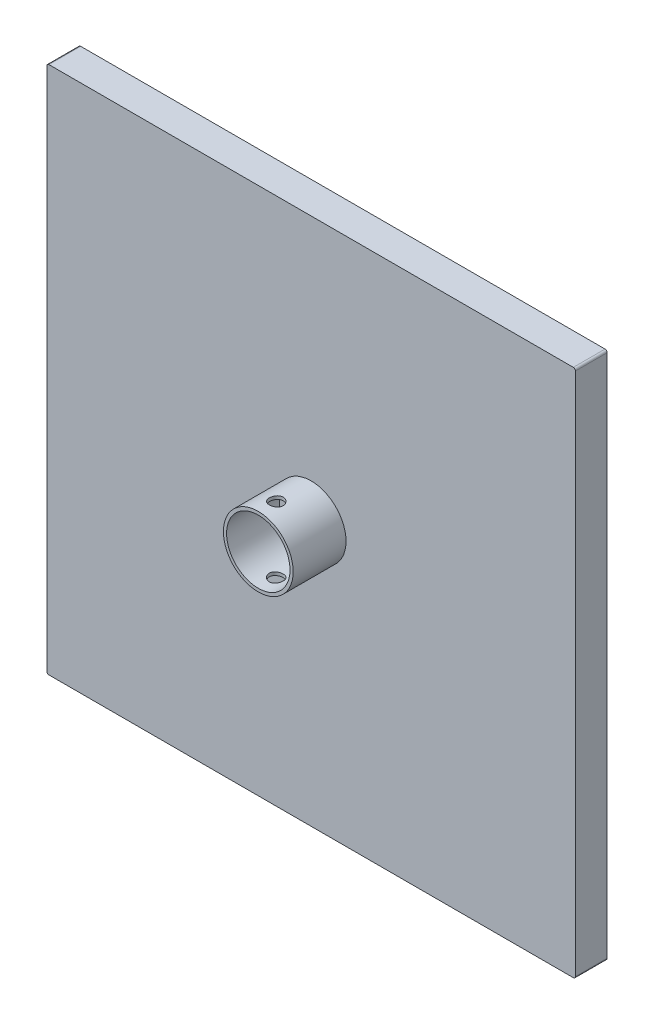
ISO-10303-21;
HEADER;
FILE_DESCRIPTION(('STEP AP214'),'2;1');
FILE_NAME('part.step','',(''),(''),'','','');
FILE_SCHEMA(('AUTOMOTIVE_DESIGN { 1 0 10303 214 1 1 1 1 }'));
ENDSEC;
DATA;
#1=APPLICATION_CONTEXT('core data for automotive mechanical design processes');
#2=APPLICATION_PROTOCOL_DEFINITION('international standard','automotive_design',2000,#1);
#3=PRODUCT_CONTEXT('',#1,'mechanical');
#4=PRODUCT('Part','Part','',(#3));
#5=PRODUCT_RELATED_PRODUCT_CATEGORY('part','',(#4));
#6=PRODUCT_DEFINITION_FORMATION('','',#4);
#7=PRODUCT_DEFINITION_CONTEXT('part definition',#1,'design');
#8=PRODUCT_DEFINITION('design','',#6,#7);
#9=PRODUCT_DEFINITION_SHAPE('','',#8);
#10=(LENGTH_UNIT() NAMED_UNIT(*) SI_UNIT(.MILLI.,.METRE.));
#11=(NAMED_UNIT(*) PLANE_ANGLE_UNIT() SI_UNIT($,.RADIAN.));
#12=(NAMED_UNIT(*) SI_UNIT($,.STERADIAN.) SOLID_ANGLE_UNIT());
#13=UNCERTAINTY_MEASURE_WITH_UNIT(LENGTH_MEASURE(1.E-05),#10,'distance_accuracy_value','');
#14=(GEOMETRIC_REPRESENTATION_CONTEXT(3) GLOBAL_UNCERTAINTY_ASSIGNED_CONTEXT((#13)) GLOBAL_UNIT_ASSIGNED_CONTEXT((#10,
#11,#12)) REPRESENTATION_CONTEXT('',''));
#15=CARTESIAN_POINT('',(0.,0.,0.));
#16=DIRECTION('',(0.,0.,1.));
#17=DIRECTION('',(1.,0.,0.));
#18=AXIS2_PLACEMENT_3D('',#15,#16,#17);
#19=CARTESIAN_POINT('',(0.,0.,80.));
#20=DIRECTION('',(0.,0.,-1.));
#21=DIRECTION('',(-1.,0.,0.));
#22=AXIS2_PLACEMENT_3D('',#19,#20,#21);
#23=CYLINDRICAL_SURFACE('',#22,33.);
#24=CARTESIAN_POINT('',(0.,-32.9999999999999,56.5));
#25=CARTESIAN_POINT('',(0.180742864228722,-33.0000017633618,56.4999964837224));
#26=CARTESIAN_POINT('',(0.361441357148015,-32.9985125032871,56.5075407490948));
#27=CARTESIAN_POINT('',(0.72158833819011,-32.9926008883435,56.5376513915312));
#28=CARTESIAN_POINT('',(0.901036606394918,-32.9881780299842,56.560220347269));
#29=CARTESIAN_POINT('',(1.25742778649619,-32.9765173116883,56.6202230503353));
#30=CARTESIAN_POINT('',(1.43436932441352,-32.969277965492,56.6576646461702));
#31=CARTESIAN_POINT('',(1.78446585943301,-32.9521836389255,56.7471338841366));
#32=CARTESIAN_POINT('',(1.95761943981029,-32.9423276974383,56.7991668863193));
#33=CARTESIAN_POINT('',(2.2986318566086,-32.9202893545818,56.9173350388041));
#34=CARTESIAN_POINT('',(2.46649742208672,-32.9081100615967,56.9834513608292));
#35=CARTESIAN_POINT('',(2.79608454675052,-32.8817465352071,57.1293609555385));
#36=CARTESIAN_POINT('',(2.9578038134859,-32.867561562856,57.2091592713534));
#37=CARTESIAN_POINT('',(3.27387029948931,-32.8375846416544,57.3817987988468));
#38=CARTESIAN_POINT('',(3.42822081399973,-32.8217934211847,57.4746341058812));
#39=CARTESIAN_POINT('',(3.72865827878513,-32.7890218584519,57.6727587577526));
#40=CARTESIAN_POINT('',(3.87474211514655,-32.77204107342,57.7780527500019));
#41=CARTESIAN_POINT('',(4.15923856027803,-32.7371579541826,58.0016165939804));
#42=CARTESIAN_POINT('',(4.29754450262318,-32.7192473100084,58.120020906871));
#43=CARTESIAN_POINT('',(4.56377361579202,-32.6831765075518,58.3680370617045));
#44=CARTESIAN_POINT('',(4.69169292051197,-32.6650162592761,58.4976530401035));
#45=CARTESIAN_POINT('',(4.93619066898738,-32.6289639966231,58.7671390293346));
#46=CARTESIAN_POINT('',(5.05277239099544,-32.6110719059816,58.907006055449));
#47=CARTESIAN_POINT('',(5.27387695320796,-32.576045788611,59.1961392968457));
#48=CARTESIAN_POINT('',(5.37839532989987,-32.5589120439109,59.3454089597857));
#49=CARTESIAN_POINT('',(5.57541962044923,-32.5257554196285,59.6535953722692));
#50=CARTESIAN_POINT('',(5.66781648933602,-32.509743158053,59.812583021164));
#51=CARTESIAN_POINT('',(5.83890204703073,-32.4794515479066,60.1380014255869));
#52=CARTESIAN_POINT('',(5.91758559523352,-32.4651728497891,60.3044349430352));
#53=CARTESIAN_POINT('',(6.06057430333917,-32.4387845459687,60.6434679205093));
#54=CARTESIAN_POINT('',(6.12488585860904,-32.4266739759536,60.8160645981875));
#55=CARTESIAN_POINT('',(6.23869092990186,-32.4049692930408,61.1662284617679));
#56=CARTESIAN_POINT('',(6.28817906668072,-32.3953760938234,61.3437974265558));
#57=CARTESIAN_POINT('',(6.41262604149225,-32.371063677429,61.8774842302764));
#58=CARTESIAN_POINT('',(6.46556070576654,-32.3604304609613,62.2393257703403));
#59=CARTESIAN_POINT('',(6.49899094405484,-32.3537175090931,62.7844112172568));
#60=CARTESIAN_POINT('',(6.50246447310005,-32.3530209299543,62.9665678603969));
#61=CARTESIAN_POINT('',(6.49413996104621,-32.3546932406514,63.3305401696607));
#62=CARTESIAN_POINT('',(6.48234168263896,-32.3570621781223,63.5123558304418));
#63=CARTESIAN_POINT('',(6.42464566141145,-32.3685924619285,64.0498874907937));
#64=CARTESIAN_POINT('',(6.35678400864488,-32.3821112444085,64.4034006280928));
#65=CARTESIAN_POINT('',(6.16399938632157,-32.4193546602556,65.0937386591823));
#66=CARTESIAN_POINT('',(6.03907376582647,-32.4430797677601,65.4305627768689));
#67=CARTESIAN_POINT('',(5.73485438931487,-32.4982369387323,66.0807547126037));
#68=CARTESIAN_POINT('',(5.55520877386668,-32.529718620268,66.3939538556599));
#69=CARTESIAN_POINT('',(5.14689842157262,-32.5968113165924,66.9860801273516));
#70=CARTESIAN_POINT('',(4.91822821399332,-32.6324227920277,67.2650034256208));
#71=CARTESIAN_POINT('',(4.41362031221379,-32.7045240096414,67.7857778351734));
#72=CARTESIAN_POINT('',(4.13692805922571,-32.741018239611,68.0268978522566));
#73=CARTESIAN_POINT('',(3.5466422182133,-32.8102040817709,68.4594145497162));
#74=CARTESIAN_POINT('',(3.2330481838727,-32.8428956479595,68.6508106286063));
#75=CARTESIAN_POINT('',(2.57706065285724,-32.9008693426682,68.9785760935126));
#76=CARTESIAN_POINT('',(2.23462529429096,-32.9261404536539,69.1148637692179));
#77=CARTESIAN_POINT('',(1.53111093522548,-32.966341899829,69.3277738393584));
#78=CARTESIAN_POINT('',(1.17003412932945,-32.9812734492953,69.4044032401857));
#79=CARTESIAN_POINT('',(0.445771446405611,-32.9989448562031,69.4947908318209));
#80=CARTESIAN_POINT('',(0.0827150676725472,-33.0018787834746,69.5095499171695));
#81=CARTESIAN_POINT('',(-0.640676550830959,-32.9957626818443,69.4784706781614));
#82=CARTESIAN_POINT('',(-1.00101193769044,-32.9867133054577,69.4326356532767));
#83=CARTESIAN_POINT('',(-1.70551738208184,-32.9577686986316,69.2825013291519));
#84=CARTESIAN_POINT('',(-2.04980075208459,-32.9379684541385,69.1787138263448));
#85=CARTESIAN_POINT('',(-2.71607876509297,-32.8897338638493,68.916177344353));
#86=CARTESIAN_POINT('',(-3.03807177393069,-32.8612988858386,68.7574243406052));
#87=CARTESIAN_POINT('',(-3.65486128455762,-32.7984655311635,68.3872903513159));
#88=CARTESIAN_POINT('',(-3.94928784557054,-32.7640001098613,68.1753045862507));
#89=CARTESIAN_POINT('',(-4.49875172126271,-32.6930898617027,67.7055166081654));
#90=CARTESIAN_POINT('',(-4.75378494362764,-32.6566448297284,67.4477096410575));
#91=CARTESIAN_POINT('',(-5.2210530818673,-32.5852329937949,66.8891144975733));
#92=CARTESIAN_POINT('',(-5.43260165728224,-32.5502959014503,66.5877487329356));
#93=CARTESIAN_POINT('',(-5.80212272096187,-32.4864703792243,65.9529674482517));
#94=CARTESIAN_POINT('',(-5.96009731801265,-32.4575817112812,65.6195531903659));
#95=CARTESIAN_POINT('',(-6.15285244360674,-32.4213902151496,65.1038164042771));
#96=CARTESIAN_POINT('',(-6.20966479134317,-32.4105316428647,64.9296746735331));
#97=CARTESIAN_POINT('',(-6.3084232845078,-32.3914549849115,64.5771003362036));
#98=CARTESIAN_POINT('',(-6.35037487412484,-32.3832359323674,64.3986693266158));
#99=CARTESIAN_POINT('',(-6.41907249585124,-32.3696884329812,64.0387912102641));
#100=CARTESIAN_POINT('',(-6.44581718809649,-32.3643602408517,63.8573438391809));
#101=CARTESIAN_POINT('',(-6.48388407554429,-32.3567555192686,63.4927766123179));
#102=CARTESIAN_POINT('',(-6.49520683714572,-32.3544788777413,63.3096568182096));
#103=CARTESIAN_POINT('',(-6.50227296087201,-32.353059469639,62.9463298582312));
#104=CARTESIAN_POINT('',(-6.49828674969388,-32.3538623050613,62.7661280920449));
#105=CARTESIAN_POINT('',(-6.47537182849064,-32.3584563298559,62.4067182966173));
#106=CARTESIAN_POINT('',(-6.45644339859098,-32.3622474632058,62.2275102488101));
#107=CARTESIAN_POINT('',(-6.40379049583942,-32.3727074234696,61.8713363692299));
#108=CARTESIAN_POINT('',(-6.37006349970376,-32.3793767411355,61.6943709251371));
#109=CARTESIAN_POINT('',(-6.28809246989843,-32.3953952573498,61.3440268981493));
#110=CARTESIAN_POINT('',(-6.23985361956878,-32.4047434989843,61.1706470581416));
#111=CARTESIAN_POINT('',(-6.12933232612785,-32.4258298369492,60.8289480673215));
#112=CARTESIAN_POINT('',(-6.06707735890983,-32.4375632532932,60.6606197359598));
#113=CARTESIAN_POINT('',(-5.92895843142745,-32.463092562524,60.3298767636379));
#114=CARTESIAN_POINT('',(-5.85309929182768,-32.4768877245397,60.1674600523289));
#115=CARTESIAN_POINT('',(-5.68826939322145,-32.506162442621,59.8494965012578));
#116=CARTESIAN_POINT('',(-5.59929322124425,-32.5216426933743,59.6939525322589));
#117=CARTESIAN_POINT('',(-5.40890824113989,-32.5538480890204,59.3908829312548));
#118=CARTESIAN_POINT('',(-5.30750370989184,-32.5705728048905,59.2433545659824));
#119=CARTESIAN_POINT('',(-5.09111539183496,-32.6051030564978,58.9548039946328));
#120=CARTESIAN_POINT('',(-4.97593144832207,-32.6229220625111,58.813933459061));
#121=CARTESIAN_POINT('',(-4.73422955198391,-32.6588730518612,58.5424114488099));
#122=CARTESIAN_POINT('',(-4.60771560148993,-32.6770049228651,58.4117563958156));
#123=CARTESIAN_POINT('',(-4.34409559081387,-32.7130943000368,58.1614161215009));
#124=CARTESIAN_POINT('',(-4.2069833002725,-32.7310516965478,58.041737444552));
#125=CARTESIAN_POINT('',(-3.92320710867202,-32.7662765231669,57.8142986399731));
#126=CARTESIAN_POINT('',(-3.77654674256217,-32.783544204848,57.7065341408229));
#127=CARTESIAN_POINT('',(-3.47302761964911,-32.817093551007,57.5025587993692));
#128=CARTESIAN_POINT('',(-3.31607795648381,-32.8333629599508,57.4064811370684));
#129=CARTESIAN_POINT('',(-2.9945341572,-32.8642486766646,57.227949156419));
#130=CARTESIAN_POINT('',(-2.82994286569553,-32.8788655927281,57.1454898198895));
#131=CARTESIAN_POINT('',(-2.49431269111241,-32.9060285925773,56.9948178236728));
#132=CARTESIAN_POINT('',(-2.32327784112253,-32.918575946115,56.9265964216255));
#133=CARTESIAN_POINT('',(-1.97594985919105,-32.9412497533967,56.8048812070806));
#134=CARTESIAN_POINT('',(-1.79965775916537,-32.9513766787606,56.7513845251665));
#135=CARTESIAN_POINT('',(-1.35708983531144,-32.9731425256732,56.6373996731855));
#136=CARTESIAN_POINT('',(-1.0883521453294,-32.9831623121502,56.5859441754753));
#137=CARTESIAN_POINT('',(-0.546375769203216,-32.9965896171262,56.5172475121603));
#138=CARTESIAN_POINT('',(-0.273137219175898,-32.9999973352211,56.5000053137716));
#139=CARTESIAN_POINT('',(0.,-32.9999999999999,56.5));
#140=B_SPLINE_CURVE_WITH_KNOTS('',3,(#24,#25,#26,#27,#28,#29,#30,#31,#32,#33,#34,#35,#36,#37,
#38,#39,#40,#41,#42,#43,#44,#45,#46,#47,#48,#49,#50,#51,#52,#53,#54,#55,#56,#57,#58,#59,#60,#61,
#62,#63,#64,#65,#66,#67,#68,#69,#70,#71,#72,#73,#74,#75,#76,#77,#78,#79,#80,#81,#82,#83,#84,#85,
#86,#87,#88,#89,#90,#91,#92,#93,#94,#95,#96,#97,#98,#99,#100,#101,#102,#103,#104,#105,#106,#107,
#108,#109,#110,#111,#112,#113,#114,#115,#116,#117,#118,#119,#120,#121,#122,#123,#124,#125,#126,
#127,#128,#129,#130,#131,#132,#133,#134,#135,#136,#137,#138,#139),.UNSPECIFIED.,.T.,.F.,(4,2,2,
2,2,2,2,2,2,2,2,2,2,2,2,2,2,2,2,2,2,2,2,2,2,2,2,2,2,2,2,2,2,2,2,2,2,2,2,2,2,2,2,2,2,2,2,2,2,2,2,
2,2,2,2,2,2,4),(0.,0.541988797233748,1.08407063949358,1.62643892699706,2.16900671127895,
2.71085362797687,3.25290069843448,3.79470305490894,4.33670815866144,4.8849034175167,
5.43330179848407,5.98154113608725,6.52998267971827,7.08306161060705,7.63634742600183,
8.18938654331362,8.74262610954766,9.83381858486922,10.3798576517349,10.9259052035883,
12.0010559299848,13.0762566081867,14.1585224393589,15.2409091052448,16.3421661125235,
17.4434364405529,18.546333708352,19.6491014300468,20.7339588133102,21.8187571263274,
22.8941234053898,23.9695684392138,25.0578330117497,26.146210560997,27.250632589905,
28.3550111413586,28.9049488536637,29.4546848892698,30.0044693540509,30.554233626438,
31.0943315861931,31.634419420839,32.1745993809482,32.7145866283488,33.2535244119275,
33.7922715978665,34.3312417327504,34.8700269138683,35.4178979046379,35.9655761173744,
36.5135787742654,37.0613796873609,37.6149319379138,38.1682797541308,38.7212867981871,
39.2741860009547,40.0932600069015,40.9123092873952),.UNSPECIFIED.);
#141=CARTESIAN_POINT('',(0.,-32.9999999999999,56.5));
#142=VERTEX_POINT('',#141);
#143=EDGE_CURVE('E174',#142,#142,#140,.T.);
#144=ORIENTED_EDGE('',*,*,#143,.F.);
#145=EDGE_LOOP('',(#144));
#146=FACE_BOUND('',#145,.T.);
#147=CARTESIAN_POINT('',(0.,0.,80.));
#148=DIRECTION('',(0.,0.,1.));
#149=DIRECTION('',(1.,0.,0.));
#150=AXIS2_PLACEMENT_3D('',#147,#148,#149);
#151=CIRCLE('',#150,33.);
#152=CARTESIAN_POINT('',(32.9999999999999,0.,80.));
#153=VERTEX_POINT('',#152);
#154=EDGE_CURVE('E132',#153,#153,#151,.T.);
#155=ORIENTED_EDGE('',*,*,#154,.F.);
#156=EDGE_LOOP('',(#155));
#157=FACE_BOUND('',#156,.T.);
#158=CARTESIAN_POINT('',(0.,0.,30.));
#159=DIRECTION('',(0.,0.,1.));
#160=DIRECTION('',(1.,0.,0.));
#161=AXIS2_PLACEMENT_3D('',#158,#159,#160);
#162=CIRCLE('',#161,33.);
#163=CARTESIAN_POINT('',(32.9999999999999,0.,30.));
#164=VERTEX_POINT('',#163);
#165=EDGE_CURVE('E138',#164,#164,#162,.T.);
#166=ORIENTED_EDGE('',*,*,#165,.T.);
#167=EDGE_LOOP('',(#166));
#168=FACE_BOUND('',#167,.T.);
#169=CARTESIAN_POINT('',(0.,33.0000000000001,56.5));
#170=CARTESIAN_POINT('',(-0.180742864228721,33.0000017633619,56.4999964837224));
#171=CARTESIAN_POINT('',(-0.361441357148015,32.9985125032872,56.5075407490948));
#172=CARTESIAN_POINT('',(-0.72158833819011,32.9926008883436,56.5376513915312));
#173=CARTESIAN_POINT('',(-0.901036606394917,32.9881780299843,56.560220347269));
#174=CARTESIAN_POINT('',(-1.25742778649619,32.9765173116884,56.6202230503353));
#175=CARTESIAN_POINT('',(-1.43436932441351,32.9692779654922,56.6576646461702));
#176=CARTESIAN_POINT('',(-1.78446585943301,32.9521836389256,56.7471338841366));
#177=CARTESIAN_POINT('',(-1.95761943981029,32.9423276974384,56.7991668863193));
#178=CARTESIAN_POINT('',(-2.29863185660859,32.9202893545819,56.9173350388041));
#179=CARTESIAN_POINT('',(-2.46649742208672,32.9081100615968,56.9834513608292));
#180=CARTESIAN_POINT('',(-2.79608454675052,32.8817465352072,57.1293609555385));
#181=CARTESIAN_POINT('',(-2.9578038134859,32.8675615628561,57.2091592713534));
#182=CARTESIAN_POINT('',(-3.27387029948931,32.8375846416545,57.3817987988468));
#183=CARTESIAN_POINT('',(-3.42822081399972,32.8217934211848,57.4746341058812));
#184=CARTESIAN_POINT('',(-3.72865827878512,32.789021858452,57.6727587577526));
#185=CARTESIAN_POINT('',(-3.87474211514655,32.7720410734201,57.7780527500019));
#186=CARTESIAN_POINT('',(-4.15923856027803,32.7371579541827,58.0016165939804));
#187=CARTESIAN_POINT('',(-4.29754450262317,32.7192473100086,58.120020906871));
#188=CARTESIAN_POINT('',(-4.56377361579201,32.6831765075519,58.3680370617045));
#189=CARTESIAN_POINT('',(-4.69169292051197,32.6650162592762,58.4976530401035));
#190=CARTESIAN_POINT('',(-4.93619066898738,32.6289639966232,58.7671390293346));
#191=CARTESIAN_POINT('',(-5.05277239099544,32.6110719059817,58.907006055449));
#192=CARTESIAN_POINT('',(-5.27387695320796,32.5760457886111,59.1961392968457));
#193=CARTESIAN_POINT('',(-5.37839532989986,32.5589120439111,59.3454089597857));
#194=CARTESIAN_POINT('',(-5.57541962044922,32.5257554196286,59.6535953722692));
#195=CARTESIAN_POINT('',(-5.66781648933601,32.5097431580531,59.812583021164));
#196=CARTESIAN_POINT('',(-5.83890204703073,32.4794515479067,60.1380014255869));
#197=CARTESIAN_POINT('',(-5.91758559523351,32.4651728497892,60.3044349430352));
#198=CARTESIAN_POINT('',(-6.06057430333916,32.4387845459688,60.6434679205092));
#199=CARTESIAN_POINT('',(-6.12488585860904,32.4266739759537,60.8160645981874));
#200=CARTESIAN_POINT('',(-6.23869092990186,32.4049692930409,61.1662284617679));
#201=CARTESIAN_POINT('',(-6.28817906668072,32.3953760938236,61.3437974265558));
#202=CARTESIAN_POINT('',(-6.41262604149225,32.3710636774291,61.8774842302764));
#203=CARTESIAN_POINT('',(-6.46556070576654,32.3604304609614,62.2393257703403));
#204=CARTESIAN_POINT('',(-6.49899094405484,32.3537175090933,62.7844112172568));
#205=CARTESIAN_POINT('',(-6.50246447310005,32.3530209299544,62.9665678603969));
#206=CARTESIAN_POINT('',(-6.49413996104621,32.3546932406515,63.3305401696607));
#207=CARTESIAN_POINT('',(-6.48234168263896,32.3570621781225,63.5123558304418));
#208=CARTESIAN_POINT('',(-6.42464566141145,32.3685924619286,64.0498874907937));
#209=CARTESIAN_POINT('',(-6.35678400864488,32.3821112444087,64.4034006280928));
#210=CARTESIAN_POINT('',(-6.16399938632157,32.4193546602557,65.0937386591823));
#211=CARTESIAN_POINT('',(-6.03907376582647,32.4430797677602,65.4305627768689));
#212=CARTESIAN_POINT('',(-5.73485438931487,32.4982369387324,66.0807547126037));
#213=CARTESIAN_POINT('',(-5.55520877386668,32.5297186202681,66.3939538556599));
#214=CARTESIAN_POINT('',(-5.14689842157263,32.5968113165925,66.9860801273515));
#215=CARTESIAN_POINT('',(-4.91822821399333,32.6324227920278,67.2650034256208));
#216=CARTESIAN_POINT('',(-4.4136203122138,32.7045240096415,67.7857778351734));
#217=CARTESIAN_POINT('',(-4.13692805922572,32.7410182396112,68.0268978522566));
#218=CARTESIAN_POINT('',(-3.5466422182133,32.810204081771,68.4594145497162));
#219=CARTESIAN_POINT('',(-3.23304818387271,32.8428956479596,68.6508106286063));
#220=CARTESIAN_POINT('',(-2.57706065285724,32.9008693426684,68.9785760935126));
#221=CARTESIAN_POINT('',(-2.23462529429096,32.926140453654,69.1148637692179));
#222=CARTESIAN_POINT('',(-1.53111093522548,32.9663418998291,69.3277738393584));
#223=CARTESIAN_POINT('',(-1.17003412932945,32.9812734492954,69.4044032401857));
#224=CARTESIAN_POINT('',(-0.445771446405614,32.9989448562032,69.4947908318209));
#225=CARTESIAN_POINT('',(-0.0827150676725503,33.0018787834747,69.5095499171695));
#226=CARTESIAN_POINT('',(0.640676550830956,32.9957626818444,69.4784706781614));
#227=CARTESIAN_POINT('',(1.00101193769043,32.9867133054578,69.4326356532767));
#228=CARTESIAN_POINT('',(1.70551738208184,32.9577686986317,69.2825013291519));
#229=CARTESIAN_POINT('',(2.04980075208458,32.9379684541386,69.1787138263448));
#230=CARTESIAN_POINT('',(2.71607876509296,32.8897338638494,68.916177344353));
#231=CARTESIAN_POINT('',(3.03807177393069,32.8612988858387,68.7574243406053));
#232=CARTESIAN_POINT('',(3.65486128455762,32.7984655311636,68.3872903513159));
#233=CARTESIAN_POINT('',(3.94928784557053,32.7640001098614,68.1753045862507));
#234=CARTESIAN_POINT('',(4.4987517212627,32.6930898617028,67.7055166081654));
#235=CARTESIAN_POINT('',(4.75378494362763,32.6566448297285,67.4477096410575));
#236=CARTESIAN_POINT('',(5.2210530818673,32.585232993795,66.8891144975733));
#237=CARTESIAN_POINT('',(5.43260165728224,32.5502959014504,66.5877487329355));
#238=CARTESIAN_POINT('',(5.80212272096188,32.4864703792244,65.9529674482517));
#239=CARTESIAN_POINT('',(5.96009731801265,32.4575817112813,65.6195531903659));
#240=CARTESIAN_POINT('',(6.15285244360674,32.4213902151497,65.1038164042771));
#241=CARTESIAN_POINT('',(6.20966479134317,32.4105316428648,64.9296746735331));
#242=CARTESIAN_POINT('',(6.3084232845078,32.3914549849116,64.5771003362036));
#243=CARTESIAN_POINT('',(6.35037487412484,32.3832359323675,64.3986693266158));
#244=CARTESIAN_POINT('',(6.41907249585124,32.3696884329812,64.0387912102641));
#245=CARTESIAN_POINT('',(6.44581718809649,32.3643602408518,63.8573438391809));
#246=CARTESIAN_POINT('',(6.48388407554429,32.3567555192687,63.4927766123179));
#247=CARTESIAN_POINT('',(6.49520683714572,32.3544788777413,63.3096568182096));
#248=CARTESIAN_POINT('',(6.50227296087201,32.3530594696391,62.9463298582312));
#249=CARTESIAN_POINT('',(6.49828674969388,32.3538623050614,62.7661280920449));
#250=CARTESIAN_POINT('',(6.47537182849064,32.358456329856,62.4067182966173));
#251=CARTESIAN_POINT('',(6.45644339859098,32.3622474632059,62.2275102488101));
#252=CARTESIAN_POINT('',(6.40379049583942,32.3727074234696,61.8713363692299));
#253=CARTESIAN_POINT('',(6.37006349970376,32.3793767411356,61.6943709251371));
#254=CARTESIAN_POINT('',(6.28809246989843,32.3953952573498,61.3440268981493));
#255=CARTESIAN_POINT('',(6.23985361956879,32.4047434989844,61.1706470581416));
#256=CARTESIAN_POINT('',(6.12933232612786,32.4258298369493,60.8289480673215));
#257=CARTESIAN_POINT('',(6.06707735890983,32.4375632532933,60.6606197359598));
#258=CARTESIAN_POINT('',(5.92895843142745,32.4630925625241,60.3298767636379));
#259=CARTESIAN_POINT('',(5.85309929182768,32.4768877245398,60.1674600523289));
#260=CARTESIAN_POINT('',(5.68826939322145,32.506162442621,59.8494965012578));
#261=CARTESIAN_POINT('',(5.59929322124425,32.5216426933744,59.693952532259));
#262=CARTESIAN_POINT('',(5.4089082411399,32.5538480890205,59.3908829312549));
#263=CARTESIAN_POINT('',(5.30750370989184,32.5705728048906,59.2433545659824));
#264=CARTESIAN_POINT('',(5.09111539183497,32.6051030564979,58.9548039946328));
#265=CARTESIAN_POINT('',(4.97593144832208,32.6229220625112,58.8139334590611));
#266=CARTESIAN_POINT('',(4.73422955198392,32.6588730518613,58.5424114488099));
#267=CARTESIAN_POINT('',(4.60771560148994,32.6770049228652,58.4117563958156));
#268=CARTESIAN_POINT('',(4.34409559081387,32.7130943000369,58.1614161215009));
#269=CARTESIAN_POINT('',(4.2069833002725,32.7310516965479,58.041737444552));
#270=CARTESIAN_POINT('',(3.92320710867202,32.766276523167,57.8142986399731));
#271=CARTESIAN_POINT('',(3.77654674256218,32.7835442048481,57.7065341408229));
#272=CARTESIAN_POINT('',(3.47302761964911,32.8170935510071,57.5025587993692));
#273=CARTESIAN_POINT('',(3.31607795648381,32.8333629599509,57.4064811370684));
#274=CARTESIAN_POINT('',(2.9945341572,32.8642486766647,57.227949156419));
#275=CARTESIAN_POINT('',(2.82994286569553,32.8788655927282,57.1454898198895));
#276=CARTESIAN_POINT('',(2.49431269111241,32.9060285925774,56.9948178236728));
#277=CARTESIAN_POINT('',(2.32327784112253,32.9185759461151,56.9265964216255));
#278=CARTESIAN_POINT('',(1.97594985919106,32.9412497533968,56.8048812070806));
#279=CARTESIAN_POINT('',(1.79965775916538,32.9513766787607,56.7513845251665));
#280=CARTESIAN_POINT('',(1.35708983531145,32.9731425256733,56.6373996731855));
#281=CARTESIAN_POINT('',(1.08835214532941,32.9831623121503,56.5859441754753));
#282=CARTESIAN_POINT('',(0.546375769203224,32.9965896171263,56.5172475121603));
#283=CARTESIAN_POINT('',(0.273137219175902,32.9999973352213,56.5000053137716));
#284=CARTESIAN_POINT('',(0.,33.0000000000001,56.5));
#285=B_SPLINE_CURVE_WITH_KNOTS('',3,(#169,#170,#171,#172,#173,#174,#175,#176,#177,#178,#179,
#180,#181,#182,#183,#184,#185,#186,#187,#188,#189,#190,#191,#192,#193,#194,#195,#196,#197,#198,
#199,#200,#201,#202,#203,#204,#205,#206,#207,#208,#209,#210,#211,#212,#213,#214,#215,#216,#217,
#218,#219,#220,#221,#222,#223,#224,#225,#226,#227,#228,#229,#230,#231,#232,#233,#234,#235,#236,
#237,#238,#239,#240,#241,#242,#243,#244,#245,#246,#247,#248,#249,#250,#251,#252,#253,#254,#255,
#256,#257,#258,#259,#260,#261,#262,#263,#264,#265,#266,#267,#268,#269,#270,#271,#272,#273,#274,
#275,#276,#277,#278,#279,#280,#281,#282,#283,#284),.UNSPECIFIED.,.T.,.F.,(4,2,2,2,2,2,2,2,2,2,2,
2,2,2,2,2,2,2,2,2,2,2,2,2,2,2,2,2,2,2,2,2,2,2,2,2,2,2,2,2,2,2,2,2,2,2,2,2,2,2,2,2,2,2,2,2,2,4),
(0.,0.541988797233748,1.08407063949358,1.62643892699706,2.16900671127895,2.71085362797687,
3.25290069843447,3.79470305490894,4.33670815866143,4.88490341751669,5.43330179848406,
5.98154113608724,6.52998267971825,7.08306161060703,7.63634742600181,8.18938654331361,
8.74262610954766,9.8338185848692,10.3798576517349,10.9259052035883,12.0010559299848,
13.0762566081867,14.1585224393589,15.2409091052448,16.3421661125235,17.4434364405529,
18.546333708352,19.6491014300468,20.7339588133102,21.8187571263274,22.8941234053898,
23.9695684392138,25.0578330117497,26.146210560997,27.250632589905,28.3550111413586,
28.9049488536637,29.4546848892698,30.0044693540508,30.554233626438,31.0943315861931,
31.634419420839,32.1745993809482,32.7145866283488,33.2535244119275,33.7922715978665,
34.3312417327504,34.8700269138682,35.4178979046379,35.9655761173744,36.5135787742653,
37.0613796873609,37.6149319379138,38.1682797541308,38.7212867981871,39.2741860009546,
40.0932600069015,40.9123092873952),.UNSPECIFIED.);
#286=CARTESIAN_POINT('',(0.,33.0000000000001,56.5));
#287=VERTEX_POINT('',#286);
#288=EDGE_CURVE('E179',#287,#287,#285,.T.);
#289=ORIENTED_EDGE('',*,*,#288,.F.);
#290=EDGE_LOOP('',(#289));
#291=FACE_BOUND('',#290,.T.);
#292=ADVANCED_FACE('F37',(#146,#157,#168,#291),#23,.T.);
#293=CARTESIAN_POINT('',(0.,0.,80.));
#294=DIRECTION('',(0.,0.,-1.));
#295=DIRECTION('',(-1.,0.,0.));
#296=AXIS2_PLACEMENT_3D('',#293,#294,#295);
#297=CYLINDRICAL_SURFACE('',#296,30.);
#298=CARTESIAN_POINT('',(0.,-29.9999999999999,56.5));
#299=CARTESIAN_POINT('',(0.180355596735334,-30.0000022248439,56.499995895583));
#300=CARTESIAN_POINT('',(0.360661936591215,-29.9983708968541,56.507508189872));
#301=CARTESIAN_POINT('',(0.720022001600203,-29.9918959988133,56.5374880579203));
#302=CARTESIAN_POINT('',(0.899075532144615,-29.9870519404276,56.5599579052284));
#303=CARTESIAN_POINT('',(1.25466133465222,-29.9742807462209,56.6196904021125));
#304=CARTESIAN_POINT('',(1.43119242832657,-29.9663522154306,56.6569597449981));
#305=CARTESIAN_POINT('',(1.78047029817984,-29.9476296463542,56.7460079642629));
#306=CARTESIAN_POINT('',(1.95321565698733,-29.9368345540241,56.7977921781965));
#307=CARTESIAN_POINT('',(2.29340522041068,-29.9126951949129,56.9153770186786));
#308=CARTESIAN_POINT('',(2.46085661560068,-29.8993545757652,56.9811576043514));
#309=CARTESIAN_POINT('',(2.78963636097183,-29.8704732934,57.126310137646));
#310=CARTESIAN_POINT('',(2.95096242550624,-29.8549318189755,57.2056870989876));
#311=CARTESIAN_POINT('',(3.26628315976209,-29.8220809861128,57.3774018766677));
#312=CARTESIAN_POINT('',(3.42028087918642,-29.8047723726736,57.4697342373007));
#313=CARTESIAN_POINT('',(3.72006420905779,-29.7688415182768,57.6667731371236));
#314=CARTESIAN_POINT('',(3.86584671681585,-29.7502187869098,57.7714843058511));
#315=CARTESIAN_POINT('',(4.15013727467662,-29.7119036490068,57.9940637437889));
#316=CARTESIAN_POINT('',(4.28851759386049,-29.6922000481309,58.1120932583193));
#317=CARTESIAN_POINT('',(4.554933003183,-29.6524996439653,58.3593506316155));
#318=CARTESIAN_POINT('',(4.68296423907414,-29.6325027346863,58.4885826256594));
#319=CARTESIAN_POINT('',(4.92773386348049,-29.5927830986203,58.7573050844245));
#320=CARTESIAN_POINT('',(5.04447538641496,-29.5730602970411,58.8967926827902));
#321=CARTESIAN_POINT('',(5.26595153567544,-29.5344273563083,59.1851837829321));
#322=CARTESIAN_POINT('',(5.37068171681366,-29.5155175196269,59.3340907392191));
#323=CARTESIAN_POINT('',(5.56838495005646,-29.4788620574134,59.6418916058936));
#324=CARTESIAN_POINT('',(5.66122319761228,-29.4611307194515,59.8008738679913));
#325=CARTESIAN_POINT('',(5.83318637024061,-29.4275655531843,60.1263550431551));
#326=CARTESIAN_POINT('',(5.91230613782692,-29.4117324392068,60.2928567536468));
#327=CARTESIAN_POINT('',(6.05614978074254,-29.3824514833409,60.6321000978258));
#328=CARTESIAN_POINT('',(6.12088030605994,-29.3690025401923,60.8048388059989));
#329=CARTESIAN_POINT('',(6.23549482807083,-29.3448799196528,61.1553600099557));
#330=CARTESIAN_POINT('',(6.28537345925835,-29.3342072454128,61.3331443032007));
#331=CARTESIAN_POINT('',(6.41070339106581,-29.307176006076,61.8666539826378));
#332=CARTESIAN_POINT('',(6.46422461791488,-29.295302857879,62.2281624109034));
#333=CARTESIAN_POINT('',(6.49859409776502,-29.2876800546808,62.7728502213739));
#334=CARTESIAN_POINT('',(6.50239088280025,-29.2868386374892,62.954890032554));
#335=CARTESIAN_POINT('',(6.4947308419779,-29.2885386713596,63.3186549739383));
#336=CARTESIAN_POINT('',(6.48327380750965,-29.291080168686,63.5003800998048));
#337=CARTESIAN_POINT('',(6.4267416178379,-29.3035627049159,64.0364907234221));
#338=CARTESIAN_POINT('',(6.35992331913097,-29.3182712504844,64.3887171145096));
#339=CARTESIAN_POINT('',(6.16968990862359,-29.3588860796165,65.0766533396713));
#340=CARTESIAN_POINT('',(6.04627167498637,-29.3847929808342,65.412362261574));
#341=CARTESIAN_POINT('',(5.74534488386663,-29.4451125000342,66.0610083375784));
#342=CARTESIAN_POINT('',(5.56742063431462,-29.4795900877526,66.3737467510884));
#343=CARTESIAN_POINT('',(5.16282569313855,-29.5531280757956,66.965314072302));
#344=CARTESIAN_POINT('',(4.93614847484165,-29.5921890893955,67.2441384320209));
#345=CARTESIAN_POINT('',(4.4347718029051,-29.6715086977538,67.7661839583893));
#346=CARTESIAN_POINT('',(4.15915589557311,-29.7117751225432,68.0085247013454));
#347=CARTESIAN_POINT('',(3.57074137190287,-29.7882138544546,68.443685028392));
#348=CARTESIAN_POINT('',(3.25794210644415,-29.8243860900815,68.6365037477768));
#349=CARTESIAN_POINT('',(2.60297638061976,-29.8886747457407,68.9673591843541));
#350=CARTESIAN_POINT('',(2.26075073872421,-29.9167744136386,69.1052822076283));
#351=CARTESIAN_POINT('',(1.5572374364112,-29.9616270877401,69.3214215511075));
#352=CARTESIAN_POINT('',(1.19595250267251,-29.9783817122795,69.39964638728));
#353=CARTESIAN_POINT('',(0.472130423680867,-29.9984267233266,69.4928921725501));
#354=CARTESIAN_POINT('',(0.109755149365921,-30.001973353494,69.5091161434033));
#355=CARTESIAN_POINT('',(-0.612527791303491,-29.9959201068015,69.4811578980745));
#356=CARTESIAN_POINT('',(-0.972435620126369,-29.9863211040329,69.436979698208));
#357=CARTESIAN_POINT('',(-1.67559309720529,-29.9552167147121,69.2904693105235));
#358=CARTESIAN_POINT('',(-2.01898010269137,-29.9338402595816,69.1887665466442));
#359=CARTESIAN_POINT('',(-2.68382182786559,-29.881572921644,68.9307901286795));
#360=CARTESIAN_POINT('',(-3.00527470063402,-29.850681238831,68.7745118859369));
#361=CARTESIAN_POINT('',(-3.62210784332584,-29.782177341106,68.4093079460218));
#362=CARTESIAN_POINT('',(-3.91705845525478,-29.7444768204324,68.1996735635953));
#363=CARTESIAN_POINT('',(-4.46802997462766,-29.6667198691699,67.7346252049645));
#364=CARTESIAN_POINT('',(-4.72404591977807,-29.6266631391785,67.479205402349));
#365=CARTESIAN_POINT('',(-5.19460588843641,-29.547827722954,66.924388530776));
#366=CARTESIAN_POINT('',(-5.40831739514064,-29.5090851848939,66.6242805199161));
#367=CARTESIAN_POINT('',(-5.7823569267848,-29.4380844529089,65.9915193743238));
#368=CARTESIAN_POINT('',(-5.94268724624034,-29.405825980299,65.6588676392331));
#369=CARTESIAN_POINT('',(-6.13899062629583,-29.3652366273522,65.1439376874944));
#370=CARTESIAN_POINT('',(-6.19697675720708,-29.3530257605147,64.970053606));
#371=CARTESIAN_POINT('',(-6.29809704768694,-29.3314963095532,64.6178609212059));
#372=CARTESIAN_POINT('',(-6.34123671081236,-29.3221766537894,64.4395539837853));
#373=CARTESIAN_POINT('',(-6.41230651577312,-29.3067166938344,64.0797981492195));
#374=CARTESIAN_POINT('',(-6.44023567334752,-29.3005765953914,63.898349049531));
#375=CARTESIAN_POINT('',(-6.48065257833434,-29.2916639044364,63.5336589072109));
#376=CARTESIAN_POINT('',(-6.49314094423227,-29.2888911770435,63.3504179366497));
#377=CARTESIAN_POINT('',(-6.50246840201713,-29.286821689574,62.9874474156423));
#378=CARTESIAN_POINT('',(-6.49963667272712,-29.2874518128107,62.8077266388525));
#379=CARTESIAN_POINT('',(-6.47910800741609,-29.2920001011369,62.4491808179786));
#380=CARTESIAN_POINT('',(-6.46141136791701,-29.2959182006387,62.2703557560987));
#381=CARTESIAN_POINT('',(-6.41129338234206,-29.3069270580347,61.9148515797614));
#382=CARTESIAN_POINT('',(-6.37886961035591,-29.3140183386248,61.7381728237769));
#383=CARTESIAN_POINT('',(-6.29957112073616,-29.3311616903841,61.3883030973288));
#384=CARTESIAN_POINT('',(-6.25270153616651,-29.341212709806,61.2151109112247));
#385=CARTESIAN_POINT('',(-6.14503677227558,-29.36394962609,60.8738681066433));
#386=CARTESIAN_POINT('',(-6.08428404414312,-29.3766274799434,60.7058035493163));
#387=CARTESIAN_POINT('',(-5.94925548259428,-29.4042701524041,60.3754642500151));
#388=CARTESIAN_POINT('',(-5.87498440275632,-29.4192341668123,60.2131874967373));
#389=CARTESIAN_POINT('',(-5.71340800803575,-29.4510398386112,59.8953643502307));
#390=CARTESIAN_POINT('',(-5.62609713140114,-29.4678822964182,59.7398208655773));
#391=CARTESIAN_POINT('',(-5.43910699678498,-29.502968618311,59.4365981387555));
#392=CARTESIAN_POINT('',(-5.3394319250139,-29.5212120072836,59.2889162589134));
#393=CARTESIAN_POINT('',(-5.1262258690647,-29.5589878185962,58.9994029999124));
#394=CARTESIAN_POINT('',(-5.01245545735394,-29.5785388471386,58.857750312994));
#395=CARTESIAN_POINT('',(-4.77353515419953,-29.6180352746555,58.5845404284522));
#396=CARTESIAN_POINT('',(-4.64838923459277,-29.6379805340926,58.4529797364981));
#397=CARTESIAN_POINT('',(-4.38744362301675,-29.677731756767,58.2006988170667));
#398=CARTESIAN_POINT('',(-4.25163768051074,-29.6975376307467,58.0799850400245));
#399=CARTESIAN_POINT('',(-3.97039055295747,-29.7364446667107,57.8503450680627));
#400=CARTESIAN_POINT('',(-3.82495292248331,-29.7555460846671,57.7414145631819));
#401=CARTESIAN_POINT('',(-3.52339886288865,-29.7927681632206,57.5346994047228));
#402=CARTESIAN_POINT('',(-3.36716758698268,-29.8108727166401,57.4370792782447));
#403=CARTESIAN_POINT('',(-3.04689528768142,-29.8453071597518,57.2554100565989));
#404=CARTESIAN_POINT('',(-2.88285717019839,-29.8616377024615,57.1713559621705));
#405=CARTESIAN_POINT('',(-2.54814737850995,-29.8920583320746,57.0174548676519));
#406=CARTESIAN_POINT('',(-2.37747943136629,-29.9061496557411,56.9476000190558));
#407=CARTESIAN_POINT('',(-2.03070615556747,-29.9316970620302,56.8226044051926));
#408=CARTESIAN_POINT('',(-1.85460181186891,-29.9431536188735,56.7674609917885));
#409=CARTESIAN_POINT('',(-1.4036458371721,-29.9683865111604,56.6470981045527));
#410=CARTESIAN_POINT('',(-1.12590670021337,-29.980176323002,56.5920175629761));
#411=CARTESIAN_POINT('',(-0.565404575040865,-29.9959811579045,56.5184725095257));
#412=CARTESIAN_POINT('',(-0.282641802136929,-29.9999965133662,56.5000064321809));
#413=CARTESIAN_POINT('',(0.,-29.9999999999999,56.5));
#414=B_SPLINE_CURVE_WITH_KNOTS('',3,(#298,#299,#300,#301,#302,#303,#304,#305,#306,#307,#308,
#309,#310,#311,#312,#313,#314,#315,#316,#317,#318,#319,#320,#321,#322,#323,#324,#325,#326,#327,
#328,#329,#330,#331,#332,#333,#334,#335,#336,#337,#338,#339,#340,#341,#342,#343,#344,#345,#346,
#347,#348,#349,#350,#351,#352,#353,#354,#355,#356,#357,#358,#359,#360,#361,#362,#363,#364,#365,
#366,#367,#368,#369,#370,#371,#372,#373,#374,#375,#376,#377,#378,#379,#380,#381,#382,#383,#384,
#385,#386,#387,#388,#389,#390,#391,#392,#393,#394,#395,#396,#397,#398,#399,#400,#401,#402,#403,
#404,#405,#406,#407,#408,#409,#410,#411,#412,#413),.UNSPECIFIED.,.T.,.F.,(4,2,2,2,2,2,2,2,2,2,2,
2,2,2,2,2,2,2,2,2,2,2,2,2,2,2,2,2,2,2,2,2,2,2,2,2,2,2,2,2,2,2,2,2,2,2,2,2,2,2,2,2,2,2,2,2,2,4),
(0.,0.540818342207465,1.08171890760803,1.62286438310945,2.16420911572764,2.70478387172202,
3.24555839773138,3.7861058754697,4.32685615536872,4.87504870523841,5.42344448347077,
5.97168756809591,6.52013289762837,7.07432936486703,7.62873373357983,8.18288134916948,
8.7372289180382,9.82777041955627,10.3734761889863,10.9191894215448,11.9901313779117,
13.0611324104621,14.1405138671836,15.2200399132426,16.3224592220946,17.4248977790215,
18.5296078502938,19.6341603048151,20.717168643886,21.8001049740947,22.8714150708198,
23.9428152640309,25.0292650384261,26.1158531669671,27.2220657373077,28.3282307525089,
28.8787873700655,29.4291396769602,29.9795275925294,30.5298934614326,31.0684813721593,
31.6070585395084,32.1457244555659,32.684199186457,33.2210489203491,33.7577102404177,
34.2946011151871,34.8313107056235,35.378873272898,35.9262453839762,36.4739408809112,
37.0214353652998,37.5760951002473,38.1305499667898,38.6846975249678,39.2387452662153,
40.0863175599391,40.9338536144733),.UNSPECIFIED.);
#415=CARTESIAN_POINT('',(0.,-29.9999999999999,56.5));
#416=VERTEX_POINT('',#415);
#417=EDGE_CURVE('E150',#416,#416,#414,.T.);
#418=ORIENTED_EDGE('',*,*,#417,.T.);
#419=EDGE_LOOP('',(#418));
#420=FACE_BOUND('',#419,.T.);
#421=CARTESIAN_POINT('',(0.,0.,80.));
#422=DIRECTION('',(0.,0.,1.));
#423=DIRECTION('',(1.,0.,0.));
#424=AXIS2_PLACEMENT_3D('',#421,#422,#423);
#425=CIRCLE('',#424,30.);
#426=CARTESIAN_POINT('',(29.9999999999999,0.,80.));
#427=VERTEX_POINT('',#426);
#428=EDGE_CURVE('E255',#427,#427,#425,.T.);
#429=ORIENTED_EDGE('',*,*,#428,.T.);
#430=EDGE_LOOP('',(#429));
#431=FACE_BOUND('',#430,.T.);
#432=CARTESIAN_POINT('',(0.,0.,30.));
#433=DIRECTION('',(0.,0.,1.));
#434=DIRECTION('',(1.,0.,0.));
#435=AXIS2_PLACEMENT_3D('',#432,#433,#434);
#436=CIRCLE('',#435,30.);
#437=CARTESIAN_POINT('',(29.9999999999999,0.,30.));
#438=VERTEX_POINT('',#437);
#439=EDGE_CURVE('E147',#438,#438,#436,.F.);
#440=ORIENTED_EDGE('',*,*,#439,.T.);
#441=EDGE_LOOP('',(#440));
#442=FACE_BOUND('',#441,.T.);
#443=CARTESIAN_POINT('',(0.,30.0000000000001,56.5));
#444=CARTESIAN_POINT('',(-0.180355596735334,30.000002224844,56.499995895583));
#445=CARTESIAN_POINT('',(-0.360661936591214,29.9983708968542,56.507508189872));
#446=CARTESIAN_POINT('',(-0.720022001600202,29.9918959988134,56.5374880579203));
#447=CARTESIAN_POINT('',(-0.899075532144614,29.9870519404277,56.5599579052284));
#448=CARTESIAN_POINT('',(-1.25466133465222,29.974280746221,56.6196904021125));
#449=CARTESIAN_POINT('',(-1.43119242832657,29.9663522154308,56.6569597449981));
#450=CARTESIAN_POINT('',(-1.78047029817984,29.9476296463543,56.7460079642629));
#451=CARTESIAN_POINT('',(-1.95321565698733,29.9368345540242,56.7977921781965));
#452=CARTESIAN_POINT('',(-2.29340522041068,29.912695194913,56.9153770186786));
#453=CARTESIAN_POINT('',(-2.46085661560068,29.8993545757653,56.9811576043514));
#454=CARTESIAN_POINT('',(-2.78963636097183,29.8704732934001,57.126310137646));
#455=CARTESIAN_POINT('',(-2.95096242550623,29.8549318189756,57.2056870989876));
#456=CARTESIAN_POINT('',(-3.26628315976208,29.8220809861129,57.3774018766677));
#457=CARTESIAN_POINT('',(-3.42028087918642,29.8047723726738,57.4697342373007));
#458=CARTESIAN_POINT('',(-3.72006420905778,29.7688415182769,57.6667731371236));
#459=CARTESIAN_POINT('',(-3.86584671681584,29.7502187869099,57.7714843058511));
#460=CARTESIAN_POINT('',(-4.15013727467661,29.7119036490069,57.9940637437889));
#461=CARTESIAN_POINT('',(-4.28851759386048,29.692200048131,58.1120932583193));
#462=CARTESIAN_POINT('',(-4.55493300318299,29.6524996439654,58.3593506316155));
#463=CARTESIAN_POINT('',(-4.68296423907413,29.6325027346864,58.4885826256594));
#464=CARTESIAN_POINT('',(-4.92773386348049,29.5927830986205,58.7573050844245));
#465=CARTESIAN_POINT('',(-5.04447538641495,29.5730602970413,58.8967926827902));
#466=CARTESIAN_POINT('',(-5.26595153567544,29.5344273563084,59.185183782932));
#467=CARTESIAN_POINT('',(-5.37068171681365,29.515517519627,59.3340907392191));
#468=CARTESIAN_POINT('',(-5.56838495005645,29.4788620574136,59.6418916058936));
#469=CARTESIAN_POINT('',(-5.66122319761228,29.4611307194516,59.8008738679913));
#470=CARTESIAN_POINT('',(-5.8331863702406,29.4275655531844,60.1263550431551));
#471=CARTESIAN_POINT('',(-5.91230613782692,29.4117324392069,60.2928567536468));
#472=CARTESIAN_POINT('',(-6.05614978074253,29.382451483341,60.6321000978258));
#473=CARTESIAN_POINT('',(-6.12088030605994,29.3690025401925,60.8048388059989));
#474=CARTESIAN_POINT('',(-6.23549482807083,29.3448799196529,61.1553600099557));
#475=CARTESIAN_POINT('',(-6.28537345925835,29.334207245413,61.3331443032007));
#476=CARTESIAN_POINT('',(-6.41070339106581,29.3071760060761,61.8666539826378));
#477=CARTESIAN_POINT('',(-6.46422461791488,29.2953028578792,62.2281624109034));
#478=CARTESIAN_POINT('',(-6.49859409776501,29.2876800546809,62.7728502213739));
#479=CARTESIAN_POINT('',(-6.50239088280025,29.2868386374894,62.954890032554));
#480=CARTESIAN_POINT('',(-6.49473084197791,29.2885386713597,63.3186549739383));
#481=CARTESIAN_POINT('',(-6.48327380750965,29.2910801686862,63.5003800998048));
#482=CARTESIAN_POINT('',(-6.42674161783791,29.3035627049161,64.0364907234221));
#483=CARTESIAN_POINT('',(-6.35992331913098,29.3182712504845,64.3887171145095));
#484=CARTESIAN_POINT('',(-6.1696899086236,29.3588860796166,65.0766533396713));
#485=CARTESIAN_POINT('',(-6.04627167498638,29.3847929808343,65.4123622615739));
#486=CARTESIAN_POINT('',(-5.74534488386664,29.4451125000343,66.0610083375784));
#487=CARTESIAN_POINT('',(-5.56742063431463,29.4795900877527,66.3737467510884));
#488=CARTESIAN_POINT('',(-5.16282569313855,29.5531280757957,66.965314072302));
#489=CARTESIAN_POINT('',(-4.93614847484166,29.5921890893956,67.2441384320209));
#490=CARTESIAN_POINT('',(-4.43477180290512,29.6715086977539,67.7661839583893));
#491=CARTESIAN_POINT('',(-4.15915589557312,29.7117751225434,68.0085247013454));
#492=CARTESIAN_POINT('',(-3.57074137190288,29.7882138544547,68.443685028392));
#493=CARTESIAN_POINT('',(-3.25794210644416,29.8243860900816,68.6365037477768));
#494=CARTESIAN_POINT('',(-2.60297638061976,29.8886747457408,68.9673591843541));
#495=CARTESIAN_POINT('',(-2.26075073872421,29.9167744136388,69.1052822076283));
#496=CARTESIAN_POINT('',(-1.5572374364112,29.9616270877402,69.3214215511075));
#497=CARTESIAN_POINT('',(-1.19595250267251,29.9783817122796,69.39964638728));
#498=CARTESIAN_POINT('',(-0.472130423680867,29.9984267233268,69.4928921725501));
#499=CARTESIAN_POINT('',(-0.109755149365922,30.0019733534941,69.5091161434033));
#500=CARTESIAN_POINT('',(0.612527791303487,29.9959201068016,69.4811578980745));
#501=CARTESIAN_POINT('',(0.972435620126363,29.986321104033,69.436979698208));
#502=CARTESIAN_POINT('',(1.67559309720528,29.9552167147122,69.2904693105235));
#503=CARTESIAN_POINT('',(2.01898010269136,29.9338402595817,69.1887665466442));
#504=CARTESIAN_POINT('',(2.68382182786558,29.8815729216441,68.9307901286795));
#505=CARTESIAN_POINT('',(3.00527470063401,29.8506812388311,68.7745118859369));
#506=CARTESIAN_POINT('',(3.62210784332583,29.7821773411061,68.4093079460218));
#507=CARTESIAN_POINT('',(3.91705845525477,29.7444768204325,68.1996735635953));
#508=CARTESIAN_POINT('',(4.46802997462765,29.66671986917,67.7346252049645));
#509=CARTESIAN_POINT('',(4.72404591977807,29.6266631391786,67.479205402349));
#510=CARTESIAN_POINT('',(5.1946058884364,29.547827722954,66.924388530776));
#511=CARTESIAN_POINT('',(5.40831739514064,29.509085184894,66.6242805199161));
#512=CARTESIAN_POINT('',(5.7823569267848,29.438084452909,65.9915193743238));
#513=CARTESIAN_POINT('',(5.94268724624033,29.4058259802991,65.6588676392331));
#514=CARTESIAN_POINT('',(6.13899062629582,29.3652366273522,65.1439376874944));
#515=CARTESIAN_POINT('',(6.19697675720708,29.3530257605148,64.970053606));
#516=CARTESIAN_POINT('',(6.29809704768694,29.3314963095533,64.6178609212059));
#517=CARTESIAN_POINT('',(6.34123671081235,29.3221766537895,64.4395539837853));
#518=CARTESIAN_POINT('',(6.41230651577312,29.3067166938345,64.0797981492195));
#519=CARTESIAN_POINT('',(6.44023567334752,29.3005765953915,63.898349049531));
#520=CARTESIAN_POINT('',(6.48065257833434,29.2916639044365,63.5336589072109));
#521=CARTESIAN_POINT('',(6.49314094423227,29.2888911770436,63.3504179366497));
#522=CARTESIAN_POINT('',(6.50246840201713,29.2868216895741,62.9874474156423));
#523=CARTESIAN_POINT('',(6.49963667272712,29.2874518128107,62.8077266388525));
#524=CARTESIAN_POINT('',(6.47910800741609,29.292000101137,62.4491808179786));
#525=CARTESIAN_POINT('',(6.46141136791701,29.2959182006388,62.2703557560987));
#526=CARTESIAN_POINT('',(6.41129338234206,29.3069270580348,61.9148515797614));
#527=CARTESIAN_POINT('',(6.37886961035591,29.3140183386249,61.7381728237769));
#528=CARTESIAN_POINT('',(6.29957112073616,29.3311616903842,61.3883030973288));
#529=CARTESIAN_POINT('',(6.25270153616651,29.3412127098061,61.2151109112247));
#530=CARTESIAN_POINT('',(6.14503677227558,29.3639496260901,60.8738681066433));
#531=CARTESIAN_POINT('',(6.08428404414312,29.3766274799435,60.7058035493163));
#532=CARTESIAN_POINT('',(5.94925548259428,29.4042701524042,60.3754642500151));
#533=CARTESIAN_POINT('',(5.87498440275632,29.4192341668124,60.2131874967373));
#534=CARTESIAN_POINT('',(5.71340800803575,29.4510398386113,59.8953643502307));
#535=CARTESIAN_POINT('',(5.62609713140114,29.4678822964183,59.7398208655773));
#536=CARTESIAN_POINT('',(5.43910699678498,29.5029686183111,59.4365981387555));
#537=CARTESIAN_POINT('',(5.33943192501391,29.5212120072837,59.2889162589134));
#538=CARTESIAN_POINT('',(5.1262258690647,29.5589878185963,58.9994029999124));
#539=CARTESIAN_POINT('',(5.01245545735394,29.5785388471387,58.857750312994));
#540=CARTESIAN_POINT('',(4.77353515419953,29.6180352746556,58.5845404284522));
#541=CARTESIAN_POINT('',(4.64838923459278,29.6379805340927,58.4529797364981));
#542=CARTESIAN_POINT('',(4.38744362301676,29.6777317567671,58.2006988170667));
#543=CARTESIAN_POINT('',(4.25163768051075,29.6975376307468,58.0799850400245));
#544=CARTESIAN_POINT('',(3.97039055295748,29.7364446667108,57.8503450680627));
#545=CARTESIAN_POINT('',(3.82495292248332,29.7555460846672,57.7414145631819));
#546=CARTESIAN_POINT('',(3.52339886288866,29.7927681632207,57.5346994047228));
#547=CARTESIAN_POINT('',(3.36716758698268,29.8108727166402,57.4370792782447));
#548=CARTESIAN_POINT('',(3.04689528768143,29.8453071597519,57.2554100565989));
#549=CARTESIAN_POINT('',(2.8828571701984,29.8616377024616,57.1713559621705));
#550=CARTESIAN_POINT('',(2.54814737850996,29.8920583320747,57.0174548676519));
#551=CARTESIAN_POINT('',(2.3774794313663,29.9061496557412,56.9476000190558));
#552=CARTESIAN_POINT('',(2.03070615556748,29.9316970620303,56.8226044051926));
#553=CARTESIAN_POINT('',(1.85460181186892,29.9431536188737,56.7674609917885));
#554=CARTESIAN_POINT('',(1.40364583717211,29.9683865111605,56.6470981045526));
#555=CARTESIAN_POINT('',(1.12590670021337,29.9801763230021,56.5920175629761));
#556=CARTESIAN_POINT('',(0.565404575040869,29.9959811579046,56.5184725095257));
#557=CARTESIAN_POINT('',(0.282641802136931,29.9999965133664,56.5000064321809));
#558=CARTESIAN_POINT('',(0.,30.0000000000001,56.5));
#559=B_SPLINE_CURVE_WITH_KNOTS('',3,(#443,#444,#445,#446,#447,#448,#449,#450,#451,#452,#453,
#454,#455,#456,#457,#458,#459,#460,#461,#462,#463,#464,#465,#466,#467,#468,#469,#470,#471,#472,
#473,#474,#475,#476,#477,#478,#479,#480,#481,#482,#483,#484,#485,#486,#487,#488,#489,#490,#491,
#492,#493,#494,#495,#496,#497,#498,#499,#500,#501,#502,#503,#504,#505,#506,#507,#508,#509,#510,
#511,#512,#513,#514,#515,#516,#517,#518,#519,#520,#521,#522,#523,#524,#525,#526,#527,#528,#529,
#530,#531,#532,#533,#534,#535,#536,#537,#538,#539,#540,#541,#542,#543,#544,#545,#546,#547,#548,
#549,#550,#551,#552,#553,#554,#555,#556,#557,#558),.UNSPECIFIED.,.T.,.F.,(4,2,2,2,2,2,2,2,2,2,2,
2,2,2,2,2,2,2,2,2,2,2,2,2,2,2,2,2,2,2,2,2,2,2,2,2,2,2,2,2,2,2,2,2,2,2,2,2,2,2,2,2,2,2,2,2,2,4),
(0.,0.540818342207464,1.08171890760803,1.62286438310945,2.16420911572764,2.70478387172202,
3.24555839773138,3.78610587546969,4.32685615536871,4.87504870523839,5.42344448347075,
5.9716875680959,6.52013289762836,7.07432936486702,7.62873373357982,8.18288134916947,
8.73722891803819,9.82777041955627,10.3734761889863,10.9191894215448,11.9901313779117,
13.0611324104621,14.1405138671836,15.2200399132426,16.3224592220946,17.4248977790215,
18.5296078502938,19.6341603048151,20.717168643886,21.8001049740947,22.8714150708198,
23.9428152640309,25.0292650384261,26.1158531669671,27.2220657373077,28.3282307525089,
28.8787873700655,29.4291396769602,29.9795275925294,30.5298934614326,31.0684813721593,
31.6070585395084,32.1457244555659,32.684199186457,33.2210489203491,33.7577102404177,
34.2946011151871,34.8313107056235,35.378873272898,35.9262453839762,36.4739408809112,
37.0214353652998,37.5760951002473,38.1305499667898,38.6846975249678,39.2387452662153,
40.0863175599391,40.9338536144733),.UNSPECIFIED.);
#560=CARTESIAN_POINT('',(0.,30.0000000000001,56.5));
#561=VERTEX_POINT('',#560);
#562=EDGE_CURVE('E157',#561,#561,#559,.T.);
#563=ORIENTED_EDGE('',*,*,#562,.T.);
#564=EDGE_LOOP('',(#563));
#565=FACE_BOUND('',#564,.T.);
#566=ADVANCED_FACE('F161',(#420,#431,#442,#565),#297,.F.);
#567=CARTESIAN_POINT('',(0.,0.,30.));
#568=DIRECTION('',(0.,0.,1.));
#569=DIRECTION('',(1.,0.,0.));
#570=AXIS2_PLACEMENT_3D('',#567,#568,#569);
#571=PLANE('',#570);
#572=DIRECTION('',(1.,0.,0.));
#573=VECTOR('',#572,1.);
#574=CARTESIAN_POINT('',(-250.,-250.,30.));
#575=LINE('',#574,#573);
#576=CARTESIAN_POINT('',(-248.,-250.,30.));
#577=VERTEX_POINT('',#576);
#578=CARTESIAN_POINT('',(248.,-250.,30.));
#579=VERTEX_POINT('',#578);
#580=EDGE_CURVE('E141',#577,#579,#575,.T.);
#581=ORIENTED_EDGE('',*,*,#580,.T.);
#582=CARTESIAN_POINT('',(248.,-248.,30.));
#583=DIRECTION('',(0.,0.,1.));
#584=DIRECTION('',(1.,0.,0.));
#585=AXIS2_PLACEMENT_3D('',#582,#583,#584);
#586=CIRCLE('',#585,2.);
#587=CARTESIAN_POINT('',(250.,-248.,30.));
#588=VERTEX_POINT('',#587);
#589=EDGE_CURVE('E227',#579,#588,#586,.T.);
#590=ORIENTED_EDGE('',*,*,#589,.T.);
#591=DIRECTION('',(0.,1.,0.));
#592=VECTOR('',#591,1.);
#593=CARTESIAN_POINT('',(250.,250.,30.));
#594=LINE('',#593,#592);
#595=CARTESIAN_POINT('',(250.,248.,30.));
#596=VERTEX_POINT('',#595);
#597=EDGE_CURVE('E124',#588,#596,#594,.T.);
#598=ORIENTED_EDGE('',*,*,#597,.T.);
#599=CARTESIAN_POINT('',(248.,248.,30.));
#600=DIRECTION('',(0.,0.,1.));
#601=DIRECTION('',(1.,0.,0.));
#602=AXIS2_PLACEMENT_3D('',#599,#600,#601);
#603=CIRCLE('',#602,2.);
#604=CARTESIAN_POINT('',(248.,250.,30.));
#605=VERTEX_POINT('',#604);
#606=EDGE_CURVE('E223',#596,#605,#603,.T.);
#607=ORIENTED_EDGE('',*,*,#606,.T.);
#608=DIRECTION('',(-1.,0.,0.));
#609=VECTOR('',#608,1.);
#610=CARTESIAN_POINT('',(-250.,250.,30.));
#611=LINE('',#610,#609);
#612=CARTESIAN_POINT('',(-248.,250.,30.));
#613=VERTEX_POINT('',#612);
#614=EDGE_CURVE('E237',#605,#613,#611,.T.);
#615=ORIENTED_EDGE('',*,*,#614,.T.);
#616=CARTESIAN_POINT('',(-248.,248.,30.));
#617=DIRECTION('',(0.,0.,1.));
#618=DIRECTION('',(1.,0.,0.));
#619=AXIS2_PLACEMENT_3D('',#616,#617,#618);
#620=CIRCLE('',#619,2.);
#621=CARTESIAN_POINT('',(-250.,248.,30.));
#622=VERTEX_POINT('',#621);
#623=EDGE_CURVE('E59',#613,#622,#620,.T.);
#624=ORIENTED_EDGE('',*,*,#623,.T.);
#625=DIRECTION('',(0.,-1.,0.));
#626=VECTOR('',#625,1.);
#627=CARTESIAN_POINT('',(-250.,250.,30.));
#628=LINE('',#627,#626);
#629=CARTESIAN_POINT('',(-250.,-248.,30.));
#630=VERTEX_POINT('',#629);
#631=EDGE_CURVE('E240',#622,#630,#628,.T.);
#632=ORIENTED_EDGE('',*,*,#631,.T.);
#633=CARTESIAN_POINT('',(-248.,-248.,30.));
#634=DIRECTION('',(0.,0.,1.));
#635=DIRECTION('',(1.,0.,0.));
#636=AXIS2_PLACEMENT_3D('',#633,#634,#635);
#637=CIRCLE('',#636,2.);
#638=EDGE_CURVE('E225',#630,#577,#637,.T.);
#639=ORIENTED_EDGE('',*,*,#638,.T.);
#640=EDGE_LOOP('',(#581,#590,#598,#607,#615,#624,#632,#639));
#641=FACE_BOUND('',#640,.T.);
#642=ORIENTED_EDGE('',*,*,#165,.F.);
#643=EDGE_LOOP('',(#642));
#644=FACE_BOUND('',#643,.T.);
#645=ADVANCED_FACE('F193',(#641,#644),#571,.T.);
#646=CARTESIAN_POINT('',(250.,250.,30.));
#647=DIRECTION('',(-1.,0.,0.));
#648=DIRECTION('',(0.,-1.,0.));
#649=AXIS2_PLACEMENT_3D('',#646,#647,#648);
#650=PLANE('',#649);
#651=ORIENTED_EDGE('',*,*,#597,.F.);
#652=DIRECTION('',(0.,0.,-1.));
#653=VECTOR('',#652,1.);
#654=CARTESIAN_POINT('',(250.,-248.,30.));
#655=LINE('',#654,#653);
#656=CARTESIAN_POINT('',(250.,-248.,0.));
#657=VERTEX_POINT('',#656);
#658=EDGE_CURVE('E108',#588,#657,#655,.T.);
#659=ORIENTED_EDGE('',*,*,#658,.T.);
#660=DIRECTION('',(0.,1.,0.));
#661=VECTOR('',#660,1.);
#662=CARTESIAN_POINT('',(250.,250.,0.));
#663=LINE('',#662,#661);
#664=CARTESIAN_POINT('',(250.,248.,0.));
#665=VERTEX_POINT('',#664);
#666=EDGE_CURVE('E121',#657,#665,#663,.T.);
#667=ORIENTED_EDGE('',*,*,#666,.T.);
#668=DIRECTION('',(0.,0.,-1.));
#669=VECTOR('',#668,1.);
#670=CARTESIAN_POINT('',(250.,248.,30.));
#671=LINE('',#670,#669);
#672=EDGE_CURVE('E126',#665,#596,#671,.F.);
#673=ORIENTED_EDGE('',*,*,#672,.T.);
#674=EDGE_LOOP('',(#651,#659,#667,#673));
#675=FACE_BOUND('',#674,.T.);
#676=ADVANCED_FACE('F120',(#675),#650,.F.);
#677=CARTESIAN_POINT('',(-250.,250.,30.));
#678=DIRECTION('',(0.,-1.,0.));
#679=DIRECTION('',(0.,0.,-1.));
#680=AXIS2_PLACEMENT_3D('',#677,#678,#679);
#681=PLANE('',#680);
#682=ORIENTED_EDGE('',*,*,#614,.F.);
#683=DIRECTION('',(0.,0.,-1.));
#684=VECTOR('',#683,1.);
#685=CARTESIAN_POINT('',(248.,250.,30.));
#686=LINE('',#685,#684);
#687=CARTESIAN_POINT('',(248.,250.,0.));
#688=VERTEX_POINT('',#687);
#689=EDGE_CURVE('E11',#605,#688,#686,.T.);
#690=ORIENTED_EDGE('',*,*,#689,.T.);
#691=DIRECTION('',(-1.,0.,0.));
#692=VECTOR('',#691,1.);
#693=CARTESIAN_POINT('',(-250.,250.,0.));
#694=LINE('',#693,#692);
#695=CARTESIAN_POINT('',(-248.,250.,0.));
#696=VERTEX_POINT('',#695);
#697=EDGE_CURVE('E131',#688,#696,#694,.T.);
#698=ORIENTED_EDGE('',*,*,#697,.T.);
#699=DIRECTION('',(0.,0.,-1.));
#700=VECTOR('',#699,1.);
#701=CARTESIAN_POINT('',(-248.,250.,30.));
#702=LINE('',#701,#700);
#703=EDGE_CURVE('E45',#696,#613,#702,.F.);
#704=ORIENTED_EDGE('',*,*,#703,.T.);
#705=EDGE_LOOP('',(#682,#690,#698,#704));
#706=FACE_BOUND('',#705,.T.);
#707=ADVANCED_FACE('F203',(#706),#681,.F.);
#708=CARTESIAN_POINT('',(-250.,250.,30.));
#709=DIRECTION('',(1.,0.,0.));
#710=DIRECTION('',(0.,1.,0.));
#711=AXIS2_PLACEMENT_3D('',#708,#709,#710);
#712=PLANE('',#711);
#713=DIRECTION('',(0.,-1.,0.));
#714=VECTOR('',#713,1.);
#715=CARTESIAN_POINT('',(-250.,250.,0.));
#716=LINE('',#715,#714);
#717=CARTESIAN_POINT('',(-250.,248.,0.));
#718=VERTEX_POINT('',#717);
#719=CARTESIAN_POINT('',(-250.,-248.,0.));
#720=VERTEX_POINT('',#719);
#721=EDGE_CURVE('E135',#718,#720,#716,.T.);
#722=ORIENTED_EDGE('',*,*,#721,.T.);
#723=DIRECTION('',(0.,0.,-1.));
#724=VECTOR('',#723,1.);
#725=CARTESIAN_POINT('',(-250.,-248.,30.));
#726=LINE('',#725,#724);
#727=EDGE_CURVE('E52',#720,#630,#726,.F.);
#728=ORIENTED_EDGE('',*,*,#727,.T.);
#729=ORIENTED_EDGE('',*,*,#631,.F.);
#730=DIRECTION('',(0.,0.,-1.));
#731=VECTOR('',#730,1.);
#732=CARTESIAN_POINT('',(-250.,248.,30.));
#733=LINE('',#732,#731);
#734=EDGE_CURVE('E233',#622,#718,#733,.T.);
#735=ORIENTED_EDGE('',*,*,#734,.T.);
#736=EDGE_LOOP('',(#722,#728,#729,#735));
#737=FACE_BOUND('',#736,.T.);
#738=ADVANCED_FACE('F199',(#737),#712,.F.);
#739=CARTESIAN_POINT('',(-250.,-250.,30.));
#740=DIRECTION('',(0.,1.,0.));
#741=DIRECTION('',(0.,0.,1.));
#742=AXIS2_PLACEMENT_3D('',#739,#740,#741);
#743=PLANE('',#742);
#744=DIRECTION('',(1.,0.,0.));
#745=VECTOR('',#744,1.);
#746=CARTESIAN_POINT('',(-250.,-250.,0.));
#747=LINE('',#746,#745);
#748=CARTESIAN_POINT('',(-248.,-250.,0.));
#749=VERTEX_POINT('',#748);
#750=CARTESIAN_POINT('',(248.,-250.,0.));
#751=VERTEX_POINT('',#750);
#752=EDGE_CURVE('E145',#749,#751,#747,.T.);
#753=ORIENTED_EDGE('',*,*,#752,.T.);
#754=DIRECTION('',(0.,0.,-1.));
#755=VECTOR('',#754,1.);
#756=CARTESIAN_POINT('',(248.,-250.,30.));
#757=LINE('',#756,#755);
#758=EDGE_CURVE('E109',#751,#579,#757,.F.);
#759=ORIENTED_EDGE('',*,*,#758,.T.);
#760=ORIENTED_EDGE('',*,*,#580,.F.);
#761=DIRECTION('',(0.,0.,-1.));
#762=VECTOR('',#761,1.);
#763=CARTESIAN_POINT('',(-248.,-250.,30.));
#764=LINE('',#763,#762);
#765=EDGE_CURVE('E114',#577,#749,#764,.T.);
#766=ORIENTED_EDGE('',*,*,#765,.T.);
#767=EDGE_LOOP('',(#753,#759,#760,#766));
#768=FACE_BOUND('',#767,.T.);
#769=ADVANCED_FACE('F196',(#768),#743,.F.);
#770=CARTESIAN_POINT('',(0.,0.,0.));
#771=DIRECTION('',(0.,0.,1.));
#772=DIRECTION('',(1.,0.,0.));
#773=AXIS2_PLACEMENT_3D('',#770,#771,#772);
#774=PLANE('',#773);
#775=ORIENTED_EDGE('',*,*,#666,.F.);
#776=CARTESIAN_POINT('',(248.,-248.,0.));
#777=DIRECTION('',(0.,0.,1.));
#778=DIRECTION('',(1.,0.,0.));
#779=AXIS2_PLACEMENT_3D('',#776,#777,#778);
#780=CIRCLE('',#779,2.);
#781=EDGE_CURVE('E104',#657,#751,#780,.F.);
#782=ORIENTED_EDGE('',*,*,#781,.T.);
#783=ORIENTED_EDGE('',*,*,#752,.F.);
#784=CARTESIAN_POINT('',(-248.,-248.,0.));
#785=DIRECTION('',(0.,0.,1.));
#786=DIRECTION('',(1.,0.,0.));
#787=AXIS2_PLACEMENT_3D('',#784,#785,#786);
#788=CIRCLE('',#787,2.);
#789=EDGE_CURVE('E115',#749,#720,#788,.F.);
#790=ORIENTED_EDGE('',*,*,#789,.T.);
#791=ORIENTED_EDGE('',*,*,#721,.F.);
#792=CARTESIAN_POINT('',(-248.,248.,0.));
#793=DIRECTION('',(0.,0.,1.));
#794=DIRECTION('',(1.,0.,0.));
#795=AXIS2_PLACEMENT_3D('',#792,#793,#794);
#796=CIRCLE('',#795,2.);
#797=EDGE_CURVE('E125',#718,#696,#796,.F.);
#798=ORIENTED_EDGE('',*,*,#797,.T.);
#799=ORIENTED_EDGE('',*,*,#697,.F.);
#800=CARTESIAN_POINT('',(248.,248.,0.));
#801=DIRECTION('',(0.,0.,1.));
#802=DIRECTION('',(1.,0.,0.));
#803=AXIS2_PLACEMENT_3D('',#800,#801,#802);
#804=CIRCLE('',#803,2.);
#805=EDGE_CURVE('E130',#688,#665,#804,.F.);
#806=ORIENTED_EDGE('',*,*,#805,.T.);
#807=EDGE_LOOP('',(#775,#782,#783,#790,#791,#798,#799,#806));
#808=FACE_BOUND('',#807,.T.);
#809=ADVANCED_FACE('F128',(#808),#774,.F.);
#810=CARTESIAN_POINT('',(0.,0.,80.));
#811=DIRECTION('',(0.,0.,1.));
#812=DIRECTION('',(1.,0.,0.));
#813=AXIS2_PLACEMENT_3D('',#810,#811,#812);
#814=PLANE('',#813);
#815=ORIENTED_EDGE('',*,*,#154,.T.);
#816=EDGE_LOOP('',(#815));
#817=FACE_BOUND('',#816,.T.);
#818=ORIENTED_EDGE('',*,*,#428,.F.);
#819=EDGE_LOOP('',(#818));
#820=FACE_BOUND('',#819,.T.);
#821=ADVANCED_FACE('F187',(#817,#820),#814,.T.);
#822=ORIENTED_EDGE('',*,*,#439,.F.);
#823=EDGE_LOOP('',(#822));
#824=FACE_BOUND('',#823,.T.);
#825=ADVANCED_FACE('F188',(#824),#571,.T.);
#826=CARTESIAN_POINT('',(0.,50.,63.));
#827=DIRECTION('',(0.,-1.,0.));
#828=DIRECTION('',(0.,0.,-1.));
#829=AXIS2_PLACEMENT_3D('',#826,#827,#828);
#830=CYLINDRICAL_SURFACE('',#829,6.5);
#831=ORIENTED_EDGE('',*,*,#417,.F.);
#832=EDGE_LOOP('',(#831));
#833=FACE_BOUND('',#832,.T.);
#834=ORIENTED_EDGE('',*,*,#143,.T.);
#835=EDGE_LOOP('',(#834));
#836=FACE_BOUND('',#835,.T.);
#837=ADVANCED_FACE('F167',(#833,#836),#830,.F.);
#838=ORIENTED_EDGE('',*,*,#562,.F.);
#839=EDGE_LOOP('',(#838));
#840=FACE_BOUND('',#839,.T.);
#841=ORIENTED_EDGE('',*,*,#288,.T.);
#842=EDGE_LOOP('',(#841));
#843=FACE_BOUND('',#842,.T.);
#844=ADVANCED_FACE('F164',(#840,#843),#830,.F.);
#845=CARTESIAN_POINT('',(248.,-248.,30.));
#846=DIRECTION('',(0.,0.,-1.));
#847=DIRECTION('',(-1.,0.,0.));
#848=AXIS2_PLACEMENT_3D('',#845,#846,#847);
#849=CYLINDRICAL_SURFACE('',#848,2.);
#850=ORIENTED_EDGE('',*,*,#589,.F.);
#851=ORIENTED_EDGE('',*,*,#758,.F.);
#852=ORIENTED_EDGE('',*,*,#781,.F.);
#853=ORIENTED_EDGE('',*,*,#658,.F.);
#854=EDGE_LOOP('',(#850,#851,#852,#853));
#855=FACE_BOUND('',#854,.T.);
#856=ADVANCED_FACE('F107',(#855),#849,.T.);
#857=CARTESIAN_POINT('',(-248.,-248.,30.));
#858=DIRECTION('',(0.,0.,-1.));
#859=DIRECTION('',(-1.,0.,0.));
#860=AXIS2_PLACEMENT_3D('',#857,#858,#859);
#861=CYLINDRICAL_SURFACE('',#860,2.);
#862=ORIENTED_EDGE('',*,*,#638,.F.);
#863=ORIENTED_EDGE('',*,*,#727,.F.);
#864=ORIENTED_EDGE('',*,*,#789,.F.);
#865=ORIENTED_EDGE('',*,*,#765,.F.);
#866=EDGE_LOOP('',(#862,#863,#864,#865));
#867=FACE_BOUND('',#866,.T.);
#868=ADVANCED_FACE('F211',(#867),#861,.T.);
#869=CARTESIAN_POINT('',(248.,248.,30.));
#870=DIRECTION('',(0.,0.,-1.));
#871=DIRECTION('',(-1.,0.,0.));
#872=AXIS2_PLACEMENT_3D('',#869,#870,#871);
#873=CYLINDRICAL_SURFACE('',#872,2.);
#874=ORIENTED_EDGE('',*,*,#606,.F.);
#875=ORIENTED_EDGE('',*,*,#672,.F.);
#876=ORIENTED_EDGE('',*,*,#805,.F.);
#877=ORIENTED_EDGE('',*,*,#689,.F.);
#878=EDGE_LOOP('',(#874,#875,#876,#877));
#879=FACE_BOUND('',#878,.T.);
#880=ADVANCED_FACE('F213',(#879),#873,.T.);
#881=CARTESIAN_POINT('',(-248.,248.,30.));
#882=DIRECTION('',(0.,0.,-1.));
#883=DIRECTION('',(-1.,0.,0.));
#884=AXIS2_PLACEMENT_3D('',#881,#882,#883);
#885=CYLINDRICAL_SURFACE('',#884,2.);
#886=ORIENTED_EDGE('',*,*,#623,.F.);
#887=ORIENTED_EDGE('',*,*,#703,.F.);
#888=ORIENTED_EDGE('',*,*,#797,.F.);
#889=ORIENTED_EDGE('',*,*,#734,.F.);
#890=EDGE_LOOP('',(#886,#887,#888,#889));
#891=FACE_BOUND('',#890,.T.);
#892=ADVANCED_FACE('F39',(#891),#885,.T.);
#893=CLOSED_SHELL('',(#292,#566,#645,#676,#707,#738,#769,#809,#821,#825,#837,#844,#856,#868,
#880,#892));
#894=MANIFOLD_SOLID_BREP('B2',#893);
#895=ADVANCED_BREP_SHAPE_REPRESENTATION('',(#18,#894),#14);
#896=SHAPE_DEFINITION_REPRESENTATION(#9,#895);
ENDSEC;
END-ISO-10303-21;
